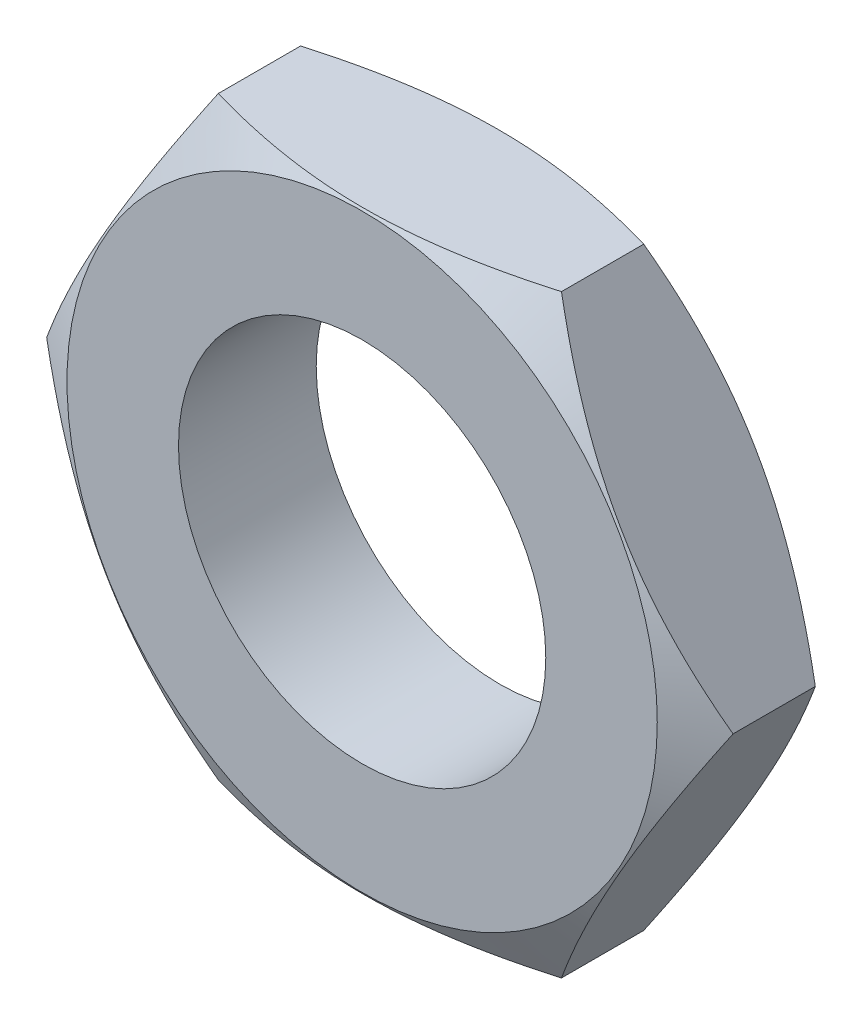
from build123d import *
from OCP.BRepFilletAPI import BRepFilletAPI_MakeChamfer

# Parameters (mm, degrees)
ESQUISSE1_R             = 7.475
ESQUISSE1_R_2           = 4
BOSS_EXTRU_1_DEPTH      = 3
CHANFREIN1_SIZE         = 1.0465
CHANFREIN1_SIZE2        = 0.604197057
ESQUISSE2_OUTSIDE_W     = 21.22
ESQUISSE2_OUTSIDE_H     = 21.22
ENL_V_MAT_EXTRU_1_DEPTH = 11.988687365


with BuildPart() as part:
    # Esquisse1 → Boss.-Extru.1 (new body)
    with BuildSketch(Plane.XY):
        Circle(ESQUISSE1_R)
        Circle(ESQUISSE1_R_2, mode=Mode.SUBTRACT)
    extrude(amount=BOSS_EXTRU_1_DEPTH)

    # Chanfrein1: one chamfer whose edges measure the first distance from different faces: ONE call of the kernel's chamfer builder (chamfer() names one face for all edges)
    chanfrein1_edges_1 = [part.edges().sort_by_distance(p)[0] for p in [
        (-7.475, 0, 0),
    ]]
    chanfrein1_side_1 = [part.faces().sort_by_distance(p)[0] for p in [
        (-7.263575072, 0, 0),
    ]]
    chanfrein1_edges_2 = [part.edges().sort_by_distance(p)[0] for p in [
        (-7.475, 0, 3),
    ]]
    chanfrein1_side_2 = [part.faces().sort_by_distance(p)[0] for p in [
        (-7.263575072, 0, 3),
    ]]
    chanfrein1 = BRepFilletAPI_MakeChamfer(part.part.solid().wrapped)
    for e in chanfrein1_edges_1:
        chanfrein1.Add(CHANFREIN1_SIZE, CHANFREIN1_SIZE2, e.wrapped, chanfrein1_side_1[0].wrapped)  # the first distance lies on this face
    for e in chanfrein1_edges_2:
        chanfrein1.Add(CHANFREIN1_SIZE, CHANFREIN1_SIZE2, e.wrapped, chanfrein1_side_2[0].wrapped)  # the first distance lies on this face
    add(Compound.cast(chanfrein1.Shape()), mode=Mode.REPLACE)

    # Esquisse2 outside → Enl_v. mat.-Extru.1 (cut, through all)
    with BuildSketch(Plane.XY.offset(3)):
        Rectangle(ESQUISSE2_OUTSIDE_W, ESQUISSE2_OUTSIDE_H)
        Polygon((7.475, 0), (3.7375, 6.473539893), (-3.7375, 6.473539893), (-7.475, 0), (-3.7375, -6.473539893), (3.7375, -6.473539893), align=None, mode=Mode.SUBTRACT)
    extrude(amount=-ENL_V_MAT_EXTRU_1_DEPTH, mode=Mode.SUBTRACT)


solid = part.part
